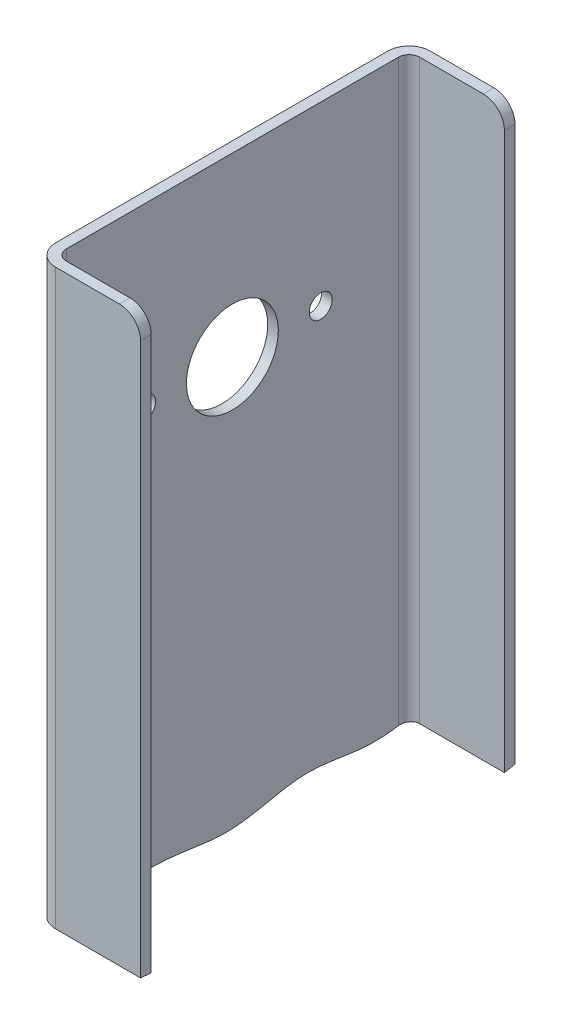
from build123d import *

# Parameters (mm, degrees)
EXTRUSION1_DEPTH        = 50
EXTRUSION1_DEPTH_BACK   = 120
CONG_1_R                = 3
CONG_2_R                = 6
ESQUISSE2_R             = 13
ENL_V_MAT_EXTRU_1_DEPTH = 60
ESQUISSE3_R             = 3.25
ENL_V_MAT_EXTRU_2_DEPTH = 60
ENL_V_MAT_EXTRU_3_DEPTH = 60


with BuildPart() as part:
    # Esquisse1 → Extrusion1 (new, two sides: drawn at the far end of the back side and taken through both)
    with BuildSketch(Plane(origin=(0, 0, 0), x_dir=(1, 0, 0), z_dir=(0, 1, 0)).offset(-EXTRUSION1_DEPTH_BACK)):
        Polygon((-173, 53), (-203, 53), (-203, -53), (-173, -53), (-173, -50), (-200, -50), (-200, 50), (-173, 50), align=None)
    extrude(amount=EXTRUSION1_DEPTH + EXTRUSION1_DEPTH_BACK)

    # Cong_1
    cong_1_edges = [part.edges().sort_by_distance(p)[0] for p in [
        (-200, -35, -50),
        (-200, -35, 50),
    ]]
    fillet(cong_1_edges, radius=CONG_1_R)

    # Cong_2
    cong_2_edges = [part.edges().sort_by_distance(p)[0] for p in [
        (-203, -35, 53),
        (-203, -35, -53),
        (-173, 50, 51.5),
        (-173, 50, -51.5),
    ]]
    fillet(cong_2_edges, radius=CONG_2_R)

    # Esquisse2 → Enl_v. mat.-Extru.1 (cut)
    with BuildSketch(Plane(origin=(-200, 0, 0), x_dir=(0, 0, -1), z_dir=(1, 0, 0))):
        Circle(ESQUISSE2_R)
    extrude(amount=-ENL_V_MAT_EXTRU_1_DEPTH, mode=Mode.SUBTRACT)

    # Esquisse3 → Enl_v. mat.-Extru.2 (cut)
    with BuildSketch(Plane(origin=(-200, 0, 0), x_dir=(0, 0, -1), z_dir=(1, 0, 0))):
        with Locations((25, 0)):
            Circle(ESQUISSE3_R)
        with Locations((-25, 0)):
            Circle(ESQUISSE3_R)
    extrude(amount=-ENL_V_MAT_EXTRU_2_DEPTH, mode=Mode.SUBTRACT)

    # Esquisse4 → Enl_v. mat.-Extru.3 (cut)
    with BuildSketch(Plane.ZY.offset(203)):
        with BuildLine():
            add(Edge.make_bspline(
                [(-76.117939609, -108.26642984), (-63.071834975, -108.904823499), (-45.504355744, -117.764317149), (-19.735292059, -110.455661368), (-0.52748101, -117.772848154), (18.877670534, -112.705959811), (39.951546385, -115.070398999), (80.218262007, -104.260663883), (99.528062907, -217.819929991), (-17.974439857, -203.054028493), (-104.339611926, -107.966714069), (-77.384259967, -108.204464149), (-76.117939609, -108.26642984)],
                knots=[0, 0, 0, 0, 0.094159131, 0.138569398, 0.19091725, 0.239875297, 0.282526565, 0.35109017, 0.509692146, 0.807043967, 0.990860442, 1, 1, 1, 1], degree=3))
        make_face()
    extrude(amount=-ENL_V_MAT_EXTRU_3_DEPTH, mode=Mode.SUBTRACT)


solid = part.part
